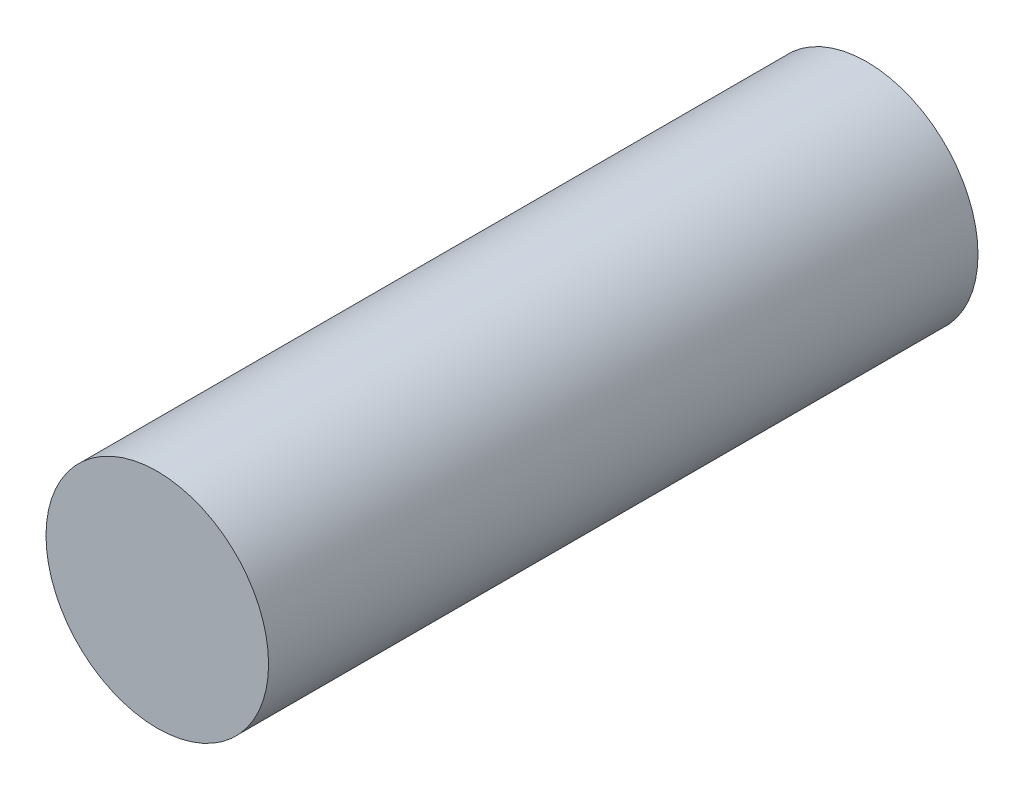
ISO-10303-21;
HEADER;
FILE_DESCRIPTION(('STEP AP214'),'2;1');
FILE_NAME('part.step','',(''),(''),'','','');
FILE_SCHEMA(('AUTOMOTIVE_DESIGN { 1 0 10303 214 1 1 1 1 }'));
ENDSEC;
DATA;
#1=APPLICATION_CONTEXT('core data for automotive mechanical design processes');
#2=APPLICATION_PROTOCOL_DEFINITION('international standard','automotive_design',2000,#1);
#3=PRODUCT_CONTEXT('',#1,'mechanical');
#4=PRODUCT('Part','Part','',(#3));
#5=PRODUCT_RELATED_PRODUCT_CATEGORY('part','',(#4));
#6=PRODUCT_DEFINITION_FORMATION('','',#4);
#7=PRODUCT_DEFINITION_CONTEXT('part definition',#1,'design');
#8=PRODUCT_DEFINITION('design','',#6,#7);
#9=PRODUCT_DEFINITION_SHAPE('','',#8);
#10=(LENGTH_UNIT() NAMED_UNIT(*) SI_UNIT(.MILLI.,.METRE.));
#11=(NAMED_UNIT(*) PLANE_ANGLE_UNIT() SI_UNIT($,.RADIAN.));
#12=(NAMED_UNIT(*) SI_UNIT($,.STERADIAN.) SOLID_ANGLE_UNIT());
#13=UNCERTAINTY_MEASURE_WITH_UNIT(LENGTH_MEASURE(1.E-05),#10,'distance_accuracy_value','');
#14=(GEOMETRIC_REPRESENTATION_CONTEXT(3) GLOBAL_UNCERTAINTY_ASSIGNED_CONTEXT((#13)) GLOBAL_UNIT_ASSIGNED_CONTEXT((#10,
#11,#12)) REPRESENTATION_CONTEXT('',''));
#15=CARTESIAN_POINT('',(0.,0.,0.));
#16=DIRECTION('',(0.,0.,1.));
#17=DIRECTION('',(1.,0.,0.));
#18=AXIS2_PLACEMENT_3D('',#15,#16,#17);
#19=CARTESIAN_POINT('',(0.,0.,51.));
#20=DIRECTION('',(0.,0.,1.));
#21=DIRECTION('',(1.,0.,0.));
#22=AXIS2_PLACEMENT_3D('',#19,#20,#21);
#23=PLANE('',#22);
#24=CARTESIAN_POINT('',(0.,0.,51.));
#25=DIRECTION('',(0.,0.,1.));
#26=DIRECTION('',(1.,0.,0.));
#27=AXIS2_PLACEMENT_3D('',#24,#25,#26);
#28=CIRCLE('',#27,8.);
#29=CARTESIAN_POINT('',(8.,0.,51.));
#30=VERTEX_POINT('',#29);
#31=EDGE_CURVE('E10',#30,#30,#28,.T.);
#32=ORIENTED_EDGE('',*,*,#31,.T.);
#33=EDGE_LOOP('',(#32));
#34=FACE_BOUND('',#33,.T.);
#35=ADVANCED_FACE('F16',(#34),#23,.T.);
#36=CARTESIAN_POINT('',(0.,0.,0.));
#37=DIRECTION('',(0.,0.,1.));
#38=DIRECTION('',(1.,0.,0.));
#39=AXIS2_PLACEMENT_3D('',#36,#37,#38);
#40=PLANE('',#39);
#41=CARTESIAN_POINT('',(0.,0.,0.));
#42=DIRECTION('',(0.,0.,1.));
#43=DIRECTION('',(1.,0.,0.));
#44=AXIS2_PLACEMENT_3D('',#41,#42,#43);
#45=CIRCLE('',#44,8.);
#46=CARTESIAN_POINT('',(8.,0.,0.));
#47=VERTEX_POINT('',#46);
#48=EDGE_CURVE('E41',#47,#47,#45,.T.);
#49=ORIENTED_EDGE('',*,*,#48,.F.);
#50=EDGE_LOOP('',(#49));
#51=FACE_BOUND('',#50,.T.);
#52=ADVANCED_FACE('F55',(#51),#40,.F.);
#53=CARTESIAN_POINT('',(0.,0.,0.));
#54=DIRECTION('',(0.,0.,-1.));
#55=DIRECTION('',(1.,0.,0.));
#56=AXIS2_PLACEMENT_3D('',#53,#54,#55);
#57=CYLINDRICAL_SURFACE('',#56,8.);
#58=ORIENTED_EDGE('',*,*,#48,.T.);
#59=DIRECTION('',(0.,0.,1.));
#60=VECTOR('',#59,1.);
#61=CARTESIAN_POINT('',(8.,0.,0.));
#62=LINE('',#61,#60);
#63=EDGE_CURVE('E24',#47,#30,#62,.T.);
#64=ORIENTED_EDGE('',*,*,#63,.T.);
#65=ORIENTED_EDGE('',*,*,#31,.F.);
#66=ORIENTED_EDGE('',*,*,#63,.F.);
#67=EDGE_LOOP('',(#58,#64,#65,#66));
#68=FACE_BOUND('',#67,.T.);
#69=ADVANCED_FACE('F39',(#68),#57,.T.);
#70=CLOSED_SHELL('',(#35,#52,#69));
#71=MANIFOLD_SOLID_BREP('B1',#70);
#72=ADVANCED_BREP_SHAPE_REPRESENTATION('',(#18,#71),#14);
#73=SHAPE_DEFINITION_REPRESENTATION(#9,#72);
ENDSEC;
END-ISO-10303-21;
